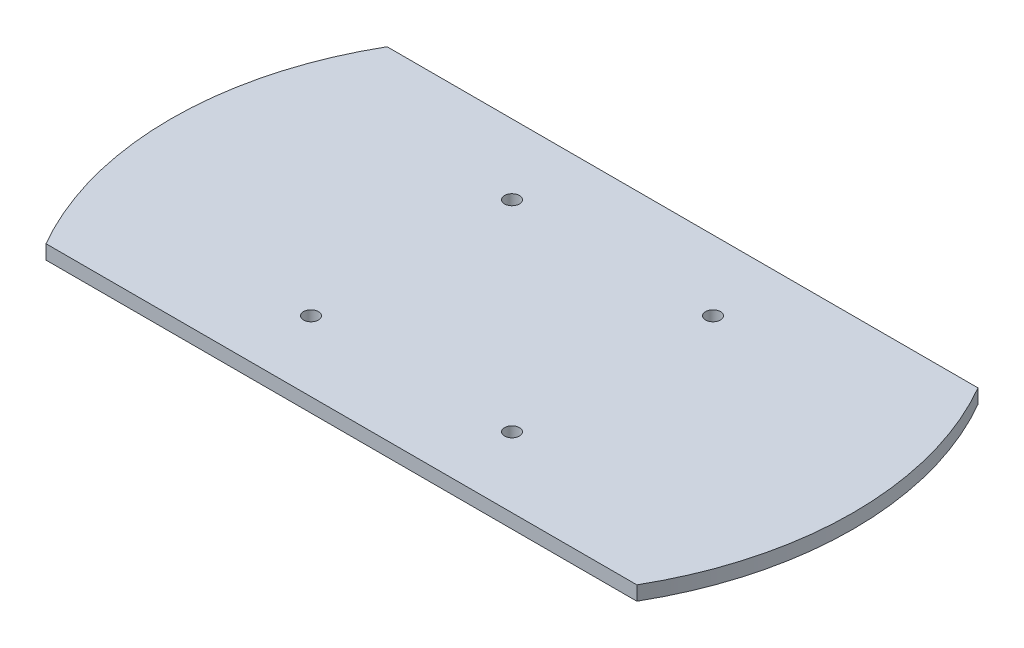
ISO-10303-21;
HEADER;
FILE_DESCRIPTION(('STEP AP214'),'2;1');
FILE_NAME('part.step','',(''),(''),'','','');
FILE_SCHEMA(('AUTOMOTIVE_DESIGN { 1 0 10303 214 1 1 1 1 }'));
ENDSEC;
DATA;
#1=APPLICATION_CONTEXT('core data for automotive mechanical design processes');
#2=APPLICATION_PROTOCOL_DEFINITION('international standard','automotive_design',2000,#1);
#3=PRODUCT_CONTEXT('',#1,'mechanical');
#4=PRODUCT('Part','Part','',(#3));
#5=PRODUCT_RELATED_PRODUCT_CATEGORY('part','',(#4));
#6=PRODUCT_DEFINITION_FORMATION('','',#4);
#7=PRODUCT_DEFINITION_CONTEXT('part definition',#1,'design');
#8=PRODUCT_DEFINITION('design','',#6,#7);
#9=PRODUCT_DEFINITION_SHAPE('','',#8);
#10=(LENGTH_UNIT() NAMED_UNIT(*) SI_UNIT(.MILLI.,.METRE.));
#11=(NAMED_UNIT(*) PLANE_ANGLE_UNIT() SI_UNIT($,.RADIAN.));
#12=(NAMED_UNIT(*) SI_UNIT($,.STERADIAN.) SOLID_ANGLE_UNIT());
#13=UNCERTAINTY_MEASURE_WITH_UNIT(LENGTH_MEASURE(1.E-05),#10,'distance_accuracy_value','');
#14=(GEOMETRIC_REPRESENTATION_CONTEXT(3) GLOBAL_UNCERTAINTY_ASSIGNED_CONTEXT((#13)) GLOBAL_UNIT_ASSIGNED_CONTEXT((#10,
#11,#12)) REPRESENTATION_CONTEXT('',''));
#15=CARTESIAN_POINT('',(0.,0.,0.));
#16=DIRECTION('',(0.,0.,1.));
#17=DIRECTION('',(1.,0.,0.));
#18=AXIS2_PLACEMENT_3D('',#15,#16,#17);
#19=CARTESIAN_POINT('',(0.,6.35,0.));
#20=DIRECTION('',(0.,-1.,0.));
#21=DIRECTION('',(0.,0.,-1.));
#22=AXIS2_PLACEMENT_3D('',#19,#20,#21);
#23=CYLINDRICAL_SURFACE('',#22,152.4);
#24=CARTESIAN_POINT('',(0.,0.,0.));
#25=DIRECTION('',(0.,1.,0.));
#26=DIRECTION('',(0.,0.,1.));
#27=AXIS2_PLACEMENT_3D('',#24,#25,#26);
#28=CIRCLE('',#27,152.4);
#29=CARTESIAN_POINT('',(-131.982271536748,0.,-76.2));
#30=VERTEX_POINT('',#29);
#31=CARTESIAN_POINT('',(-131.982271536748,0.,76.2));
#32=VERTEX_POINT('',#31);
#33=EDGE_CURVE('E94',#30,#32,#28,.T.);
#34=ORIENTED_EDGE('',*,*,#33,.T.);
#35=DIRECTION('',(0.,-1.,0.));
#36=VECTOR('',#35,1.);
#37=CARTESIAN_POINT('',(-131.982271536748,6.35,76.2));
#38=LINE('',#37,#36);
#39=CARTESIAN_POINT('',(-131.982271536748,6.35,76.2));
#40=VERTEX_POINT('',#39);
#41=EDGE_CURVE('E11',#40,#32,#38,.T.);
#42=ORIENTED_EDGE('',*,*,#41,.F.);
#43=CARTESIAN_POINT('',(0.,6.35,0.));
#44=DIRECTION('',(0.,1.,0.));
#45=DIRECTION('',(0.,0.,1.));
#46=AXIS2_PLACEMENT_3D('',#43,#44,#45);
#47=CIRCLE('',#46,152.4);
#48=CARTESIAN_POINT('',(-131.982271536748,6.35,-76.2));
#49=VERTEX_POINT('',#48);
#50=EDGE_CURVE('E82',#49,#40,#47,.T.);
#51=ORIENTED_EDGE('',*,*,#50,.F.);
#52=DIRECTION('',(0.,-1.,0.));
#53=VECTOR('',#52,1.);
#54=CARTESIAN_POINT('',(-131.982271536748,6.35,-76.2));
#55=LINE('',#54,#53);
#56=EDGE_CURVE('E90',#49,#30,#55,.T.);
#57=ORIENTED_EDGE('',*,*,#56,.T.);
#58=EDGE_LOOP('',(#34,#42,#51,#57));
#59=FACE_BOUND('',#58,.T.);
#60=ADVANCED_FACE('F31',(#59),#23,.T.);
#61=CARTESIAN_POINT('',(-131.982271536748,6.35,76.2));
#62=DIRECTION('',(0.,0.,-1.));
#63=DIRECTION('',(-1.,0.,0.));
#64=AXIS2_PLACEMENT_3D('',#61,#62,#63);
#65=PLANE('',#64);
#66=DIRECTION('',(1.,0.,0.));
#67=VECTOR('',#66,1.);
#68=CARTESIAN_POINT('',(-131.982271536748,0.,76.2));
#69=LINE('',#68,#67);
#70=CARTESIAN_POINT('',(131.982271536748,0.,76.2));
#71=VERTEX_POINT('',#70);
#72=EDGE_CURVE('E86',#32,#71,#69,.T.);
#73=ORIENTED_EDGE('',*,*,#72,.T.);
#74=DIRECTION('',(0.,-1.,0.));
#75=VECTOR('',#74,1.);
#76=CARTESIAN_POINT('',(131.982271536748,6.35,76.2));
#77=LINE('',#76,#75);
#78=CARTESIAN_POINT('',(131.982271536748,6.35,76.2));
#79=VERTEX_POINT('',#78);
#80=EDGE_CURVE('E39',#79,#71,#77,.T.);
#81=ORIENTED_EDGE('',*,*,#80,.F.);
#82=DIRECTION('',(1.,0.,0.));
#83=VECTOR('',#82,1.);
#84=CARTESIAN_POINT('',(-131.982271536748,6.35,76.2));
#85=LINE('',#84,#83);
#86=EDGE_CURVE('E77',#40,#79,#85,.T.);
#87=ORIENTED_EDGE('',*,*,#86,.F.);
#88=ORIENTED_EDGE('',*,*,#41,.T.);
#89=EDGE_LOOP('',(#73,#81,#87,#88));
#90=FACE_BOUND('',#89,.T.);
#91=ADVANCED_FACE('F85',(#90),#65,.F.);
#92=CARTESIAN_POINT('',(0.,6.35,0.));
#93=DIRECTION('',(0.,-1.,0.));
#94=DIRECTION('',(0.,0.,-1.));
#95=AXIS2_PLACEMENT_3D('',#92,#93,#94);
#96=CYLINDRICAL_SURFACE('',#95,152.4);
#97=CARTESIAN_POINT('',(0.,0.,0.));
#98=DIRECTION('',(0.,1.,0.));
#99=DIRECTION('',(0.,0.,1.));
#100=AXIS2_PLACEMENT_3D('',#97,#98,#99);
#101=CIRCLE('',#100,152.4);
#102=CARTESIAN_POINT('',(131.982271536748,0.,-76.2));
#103=VERTEX_POINT('',#102);
#104=EDGE_CURVE('E64',#71,#103,#101,.T.);
#105=ORIENTED_EDGE('',*,*,#104,.T.);
#106=DIRECTION('',(0.,-1.,0.));
#107=VECTOR('',#106,1.);
#108=CARTESIAN_POINT('',(131.982271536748,6.35,-76.2));
#109=LINE('',#108,#107);
#110=CARTESIAN_POINT('',(131.982271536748,6.35,-76.2));
#111=VERTEX_POINT('',#110);
#112=EDGE_CURVE('E87',#111,#103,#109,.T.);
#113=ORIENTED_EDGE('',*,*,#112,.F.);
#114=CARTESIAN_POINT('',(0.,6.35,0.));
#115=DIRECTION('',(0.,1.,0.));
#116=DIRECTION('',(0.,0.,1.));
#117=AXIS2_PLACEMENT_3D('',#114,#115,#116);
#118=CIRCLE('',#117,152.4);
#119=EDGE_CURVE('E80',#79,#111,#118,.T.);
#120=ORIENTED_EDGE('',*,*,#119,.F.);
#121=ORIENTED_EDGE('',*,*,#80,.T.);
#122=EDGE_LOOP('',(#105,#113,#120,#121));
#123=FACE_BOUND('',#122,.T.);
#124=ADVANCED_FACE('F88',(#123),#96,.T.);
#125=CARTESIAN_POINT('',(-131.982271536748,6.35,-76.2));
#126=DIRECTION('',(0.,0.,1.));
#127=DIRECTION('',(1.,0.,0.));
#128=AXIS2_PLACEMENT_3D('',#125,#126,#127);
#129=PLANE('',#128);
#130=DIRECTION('',(-1.,0.,0.));
#131=VECTOR('',#130,1.);
#132=CARTESIAN_POINT('',(-131.982271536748,0.,-76.2));
#133=LINE('',#132,#131);
#134=EDGE_CURVE('E70',#103,#30,#133,.T.);
#135=ORIENTED_EDGE('',*,*,#134,.T.);
#136=ORIENTED_EDGE('',*,*,#56,.F.);
#137=DIRECTION('',(-1.,0.,0.));
#138=VECTOR('',#137,1.);
#139=CARTESIAN_POINT('',(-131.982271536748,6.35,-76.2));
#140=LINE('',#139,#138);
#141=EDGE_CURVE('E47',#111,#49,#140,.T.);
#142=ORIENTED_EDGE('',*,*,#141,.F.);
#143=ORIENTED_EDGE('',*,*,#112,.T.);
#144=EDGE_LOOP('',(#135,#136,#142,#143));
#145=FACE_BOUND('',#144,.T.);
#146=ADVANCED_FACE('F102',(#145),#129,.F.);
#147=CARTESIAN_POINT('',(0.,6.35,0.));
#148=DIRECTION('',(0.,1.,0.));
#149=DIRECTION('',(0.,0.,1.));
#150=AXIS2_PLACEMENT_3D('',#147,#148,#149);
#151=PLANE('',#150);
#152=CARTESIAN_POINT('',(44.901280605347,6.35,44.9012806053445));
#153=DIRECTION('',(0.,1.,0.));
#154=DIRECTION('',(1.,0.,0.));
#155=AXIS2_PLACEMENT_3D('',#152,#153,#154);
#156=CIRCLE('',#155,3.30200000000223);
#157=CARTESIAN_POINT('',(48.2032806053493,6.35,44.9012806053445));
#158=VERTEX_POINT('',#157);
#159=EDGE_CURVE('E123',#158,#158,#156,.T.);
#160=ORIENTED_EDGE('',*,*,#159,.F.);
#161=EDGE_LOOP('',(#160));
#162=FACE_BOUND('',#161,.T.);
#163=CARTESIAN_POINT('',(44.9012806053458,6.35,-44.901280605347));
#164=DIRECTION('',(0.,1.,0.));
#165=DIRECTION('',(1.,0.,0.));
#166=AXIS2_PLACEMENT_3D('',#163,#164,#165);
#167=CIRCLE('',#166,3.30200000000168);
#168=CARTESIAN_POINT('',(48.2032806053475,6.35,-44.901280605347));
#169=VERTEX_POINT('',#168);
#170=EDGE_CURVE('E117',#169,#169,#167,.T.);
#171=ORIENTED_EDGE('',*,*,#170,.F.);
#172=EDGE_LOOP('',(#171));
#173=FACE_BOUND('',#172,.T.);
#174=CARTESIAN_POINT('',(-44.9012806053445,6.35,44.9012806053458));
#175=DIRECTION('',(0.,1.,0.));
#176=DIRECTION('',(1.,0.,0.));
#177=AXIS2_PLACEMENT_3D('',#174,#175,#176);
#178=CIRCLE('',#177,3.30200000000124);
#179=CARTESIAN_POINT('',(-41.5992806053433,6.35,44.9012806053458));
#180=VERTEX_POINT('',#179);
#181=EDGE_CURVE('E111',#180,#180,#178,.T.);
#182=ORIENTED_EDGE('',*,*,#181,.F.);
#183=EDGE_LOOP('',(#182));
#184=FACE_BOUND('',#183,.T.);
#185=CARTESIAN_POINT('',(-44.9012806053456,6.35,-44.901280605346));
#186=DIRECTION('',(0.,1.,0.));
#187=DIRECTION('',(1.,0.,0.));
#188=AXIS2_PLACEMENT_3D('',#185,#186,#187);
#189=CIRCLE('',#188,3.30200000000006);
#190=CARTESIAN_POINT('',(-41.5992806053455,6.35,-44.901280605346));
#191=VERTEX_POINT('',#190);
#192=EDGE_CURVE('E108',#191,#191,#189,.T.);
#193=ORIENTED_EDGE('',*,*,#192,.F.);
#194=EDGE_LOOP('',(#193));
#195=FACE_BOUND('',#194,.T.);
#196=ORIENTED_EDGE('',*,*,#50,.T.);
#197=ORIENTED_EDGE('',*,*,#86,.T.);
#198=ORIENTED_EDGE('',*,*,#119,.T.);
#199=ORIENTED_EDGE('',*,*,#141,.T.);
#200=EDGE_LOOP('',(#196,#197,#198,#199));
#201=FACE_BOUND('',#200,.T.);
#202=ADVANCED_FACE('F78',(#162,#173,#184,#195,#201),#151,.T.);
#203=CARTESIAN_POINT('',(0.,0.,0.));
#204=DIRECTION('',(0.,1.,0.));
#205=DIRECTION('',(0.,0.,1.));
#206=AXIS2_PLACEMENT_3D('',#203,#204,#205);
#207=PLANE('',#206);
#208=CARTESIAN_POINT('',(44.901280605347,0.,44.9012806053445));
#209=DIRECTION('',(0.,1.,0.));
#210=DIRECTION('',(1.,0.,0.));
#211=AXIS2_PLACEMENT_3D('',#208,#209,#210);
#212=CIRCLE('',#211,3.30200000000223);
#213=CARTESIAN_POINT('',(48.2032806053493,0.,44.9012806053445));
#214=VERTEX_POINT('',#213);
#215=EDGE_CURVE('E126',#214,#214,#212,.T.);
#216=ORIENTED_EDGE('',*,*,#215,.T.);
#217=EDGE_LOOP('',(#216));
#218=FACE_BOUND('',#217,.T.);
#219=CARTESIAN_POINT('',(44.9012806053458,0.,-44.901280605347));
#220=DIRECTION('',(0.,1.,0.));
#221=DIRECTION('',(1.,0.,0.));
#222=AXIS2_PLACEMENT_3D('',#219,#220,#221);
#223=CIRCLE('',#222,3.30200000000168);
#224=CARTESIAN_POINT('',(48.2032806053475,0.,-44.901280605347));
#225=VERTEX_POINT('',#224);
#226=EDGE_CURVE('E120',#225,#225,#223,.T.);
#227=ORIENTED_EDGE('',*,*,#226,.T.);
#228=EDGE_LOOP('',(#227));
#229=FACE_BOUND('',#228,.T.);
#230=CARTESIAN_POINT('',(-44.9012806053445,0.,44.9012806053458));
#231=DIRECTION('',(0.,1.,0.));
#232=DIRECTION('',(1.,0.,0.));
#233=AXIS2_PLACEMENT_3D('',#230,#231,#232);
#234=CIRCLE('',#233,3.30200000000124);
#235=CARTESIAN_POINT('',(-41.5992806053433,0.,44.9012806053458));
#236=VERTEX_POINT('',#235);
#237=EDGE_CURVE('E114',#236,#236,#234,.T.);
#238=ORIENTED_EDGE('',*,*,#237,.T.);
#239=EDGE_LOOP('',(#238));
#240=FACE_BOUND('',#239,.T.);
#241=CARTESIAN_POINT('',(-44.9012806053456,0.,-44.901280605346));
#242=DIRECTION('',(0.,1.,0.));
#243=DIRECTION('',(1.,0.,0.));
#244=AXIS2_PLACEMENT_3D('',#241,#242,#243);
#245=CIRCLE('',#244,3.30200000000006);
#246=CARTESIAN_POINT('',(-41.5992806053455,0.,-44.901280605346));
#247=VERTEX_POINT('',#246);
#248=EDGE_CURVE('E97',#247,#247,#245,.T.);
#249=ORIENTED_EDGE('',*,*,#248,.T.);
#250=EDGE_LOOP('',(#249));
#251=FACE_BOUND('',#250,.T.);
#252=ORIENTED_EDGE('',*,*,#33,.F.);
#253=ORIENTED_EDGE('',*,*,#134,.F.);
#254=ORIENTED_EDGE('',*,*,#104,.F.);
#255=ORIENTED_EDGE('',*,*,#72,.F.);
#256=EDGE_LOOP('',(#252,#253,#254,#255));
#257=FACE_BOUND('',#256,.T.);
#258=ADVANCED_FACE('F105',(#218,#229,#240,#251,#257),#207,.F.);
#259=CARTESIAN_POINT('',(-44.9012806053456,0.,-44.901280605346));
#260=DIRECTION('',(0.,1.,0.));
#261=DIRECTION('',(0.,0.,1.));
#262=AXIS2_PLACEMENT_3D('',#259,#260,#261);
#263=CYLINDRICAL_SURFACE('',#262,3.30200000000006);
#264=ORIENTED_EDGE('',*,*,#248,.F.);
#265=EDGE_LOOP('',(#264));
#266=FACE_BOUND('',#265,.T.);
#267=ORIENTED_EDGE('',*,*,#192,.T.);
#268=EDGE_LOOP('',(#267));
#269=FACE_BOUND('',#268,.T.);
#270=ADVANCED_FACE('F143',(#266,#269),#263,.F.);
#271=CARTESIAN_POINT('',(-44.9012806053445,0.,44.9012806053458));
#272=DIRECTION('',(0.,1.,0.));
#273=DIRECTION('',(0.,0.,1.));
#274=AXIS2_PLACEMENT_3D('',#271,#272,#273);
#275=CYLINDRICAL_SURFACE('',#274,3.30200000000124);
#276=ORIENTED_EDGE('',*,*,#237,.F.);
#277=EDGE_LOOP('',(#276));
#278=FACE_BOUND('',#277,.T.);
#279=ORIENTED_EDGE('',*,*,#181,.T.);
#280=EDGE_LOOP('',(#279));
#281=FACE_BOUND('',#280,.T.);
#282=ADVANCED_FACE('F145',(#278,#281),#275,.F.);
#283=CARTESIAN_POINT('',(44.9012806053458,0.,-44.901280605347));
#284=DIRECTION('',(0.,1.,0.));
#285=DIRECTION('',(0.,0.,1.));
#286=AXIS2_PLACEMENT_3D('',#283,#284,#285);
#287=CYLINDRICAL_SURFACE('',#286,3.30200000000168);
#288=ORIENTED_EDGE('',*,*,#226,.F.);
#289=EDGE_LOOP('',(#288));
#290=FACE_BOUND('',#289,.T.);
#291=ORIENTED_EDGE('',*,*,#170,.T.);
#292=EDGE_LOOP('',(#291));
#293=FACE_BOUND('',#292,.T.);
#294=ADVANCED_FACE('F152',(#290,#293),#287,.F.);
#295=CARTESIAN_POINT('',(44.901280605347,0.,44.9012806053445));
#296=DIRECTION('',(0.,1.,0.));
#297=DIRECTION('',(0.,0.,1.));
#298=AXIS2_PLACEMENT_3D('',#295,#296,#297);
#299=CYLINDRICAL_SURFACE('',#298,3.30200000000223);
#300=ORIENTED_EDGE('',*,*,#215,.F.);
#301=EDGE_LOOP('',(#300));
#302=FACE_BOUND('',#301,.T.);
#303=ORIENTED_EDGE('',*,*,#159,.T.);
#304=EDGE_LOOP('',(#303));
#305=FACE_BOUND('',#304,.T.);
#306=ADVANCED_FACE('F132',(#302,#305),#299,.F.);
#307=CLOSED_SHELL('',(#60,#91,#124,#146,#202,#258,#270,#282,#294,#306));
#308=MANIFOLD_SOLID_BREP('B2',#307);
#309=ADVANCED_BREP_SHAPE_REPRESENTATION('',(#18,#308),#14);
#310=SHAPE_DEFINITION_REPRESENTATION(#9,#309);
ENDSEC;
END-ISO-10303-21;
